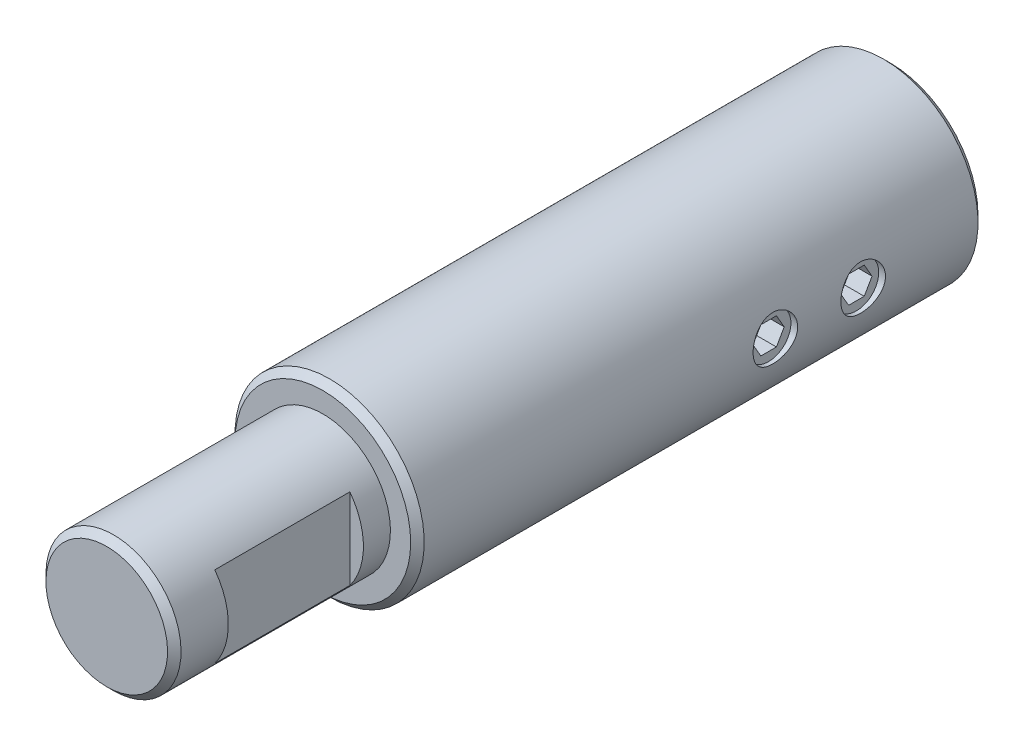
ISO-10303-21;
HEADER;
FILE_DESCRIPTION(('STEP AP214'),'2;1');
FILE_NAME('part.step','',(''),(''),'','','');
FILE_SCHEMA(('AUTOMOTIVE_DESIGN { 1 0 10303 214 1 1 1 1 }'));
ENDSEC;
DATA;
#1=APPLICATION_CONTEXT('core data for automotive mechanical design processes');
#2=APPLICATION_PROTOCOL_DEFINITION('international standard','automotive_design',2000,#1);
#3=PRODUCT_CONTEXT('',#1,'mechanical');
#4=PRODUCT('Part','Part','',(#3));
#5=PRODUCT_RELATED_PRODUCT_CATEGORY('part','',(#4));
#6=PRODUCT_DEFINITION_FORMATION('','',#4);
#7=PRODUCT_DEFINITION_CONTEXT('part definition',#1,'design');
#8=PRODUCT_DEFINITION('design','',#6,#7);
#9=PRODUCT_DEFINITION_SHAPE('','',#8);
#10=(LENGTH_UNIT() NAMED_UNIT(*) SI_UNIT(.MILLI.,.METRE.));
#11=(NAMED_UNIT(*) PLANE_ANGLE_UNIT() SI_UNIT($,.RADIAN.));
#12=(NAMED_UNIT(*) SI_UNIT($,.STERADIAN.) SOLID_ANGLE_UNIT());
#13=UNCERTAINTY_MEASURE_WITH_UNIT(LENGTH_MEASURE(1.E-05),#10,'distance_accuracy_value','');
#14=(GEOMETRIC_REPRESENTATION_CONTEXT(3) GLOBAL_UNCERTAINTY_ASSIGNED_CONTEXT((#13)) GLOBAL_UNIT_ASSIGNED_CONTEXT((#10,
#11,#12)) REPRESENTATION_CONTEXT('',''));
#15=CARTESIAN_POINT('',(0.,0.,0.));
#16=DIRECTION('',(0.,0.,1.));
#17=DIRECTION('',(1.,0.,0.));
#18=AXIS2_PLACEMENT_3D('',#15,#16,#17);
#19=CARTESIAN_POINT('',(5.,-1.,16.0773502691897));
#20=DIRECTION('',(1.,0.,0.));
#21=DIRECTION('',(0.,0.5,0.866025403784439));
#22=AXIS2_PLACEMENT_3D('',#19,#20,#21);
#23=PLANE('',#22);
#24=DIRECTION('',(0.,-0.866025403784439,-0.5));
#25=VECTOR('',#24,1.);
#26=CARTESIAN_POINT('',(5.,0.,16.6547005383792));
#27=LINE('',#26,#25);
#28=CARTESIAN_POINT('',(5.,0.,16.6547005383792));
#29=VERTEX_POINT('',#28);
#30=CARTESIAN_POINT('',(5.,-1.,16.0773502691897));
#31=VERTEX_POINT('',#30);
#32=EDGE_CURVE('E96',#29,#31,#27,.T.);
#33=ORIENTED_EDGE('',*,*,#32,.T.);
#34=DIRECTION('',(0.,0.,-1.));
#35=VECTOR('',#34,1.);
#36=CARTESIAN_POINT('',(5.,-1.,16.0773502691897));
#37=LINE('',#36,#35);
#38=CARTESIAN_POINT('',(5.,-1.,14.9226497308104));
#39=VERTEX_POINT('',#38);
#40=EDGE_CURVE('E732',#31,#39,#37,.T.);
#41=ORIENTED_EDGE('',*,*,#40,.T.);
#42=DIRECTION('',(0.,0.866025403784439,-0.5));
#43=VECTOR('',#42,1.);
#44=CARTESIAN_POINT('',(5.,-1.,14.9226497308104));
#45=LINE('',#44,#43);
#46=CARTESIAN_POINT('',(5.,0.,14.3452994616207));
#47=VERTEX_POINT('',#46);
#48=EDGE_CURVE('E728',#39,#47,#45,.T.);
#49=ORIENTED_EDGE('',*,*,#48,.T.);
#50=DIRECTION('',(0.,0.866025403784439,0.5));
#51=VECTOR('',#50,1.);
#52=CARTESIAN_POINT('',(5.,0.,14.3452994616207));
#53=LINE('',#52,#51);
#54=CARTESIAN_POINT('',(5.,1.,14.9226497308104));
#55=VERTEX_POINT('',#54);
#56=EDGE_CURVE('E731',#47,#55,#53,.T.);
#57=ORIENTED_EDGE('',*,*,#56,.T.);
#58=DIRECTION('',(0.,0.,1.));
#59=VECTOR('',#58,1.);
#60=CARTESIAN_POINT('',(5.,1.,14.9226497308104));
#61=LINE('',#60,#59);
#62=CARTESIAN_POINT('',(5.,1.,16.0773502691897));
#63=VERTEX_POINT('',#62);
#64=EDGE_CURVE('E736',#55,#63,#61,.T.);
#65=ORIENTED_EDGE('',*,*,#64,.T.);
#66=DIRECTION('',(0.,-0.866025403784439,0.5));
#67=VECTOR('',#66,1.);
#68=CARTESIAN_POINT('',(5.,1.,16.0773502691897));
#69=LINE('',#68,#67);
#70=EDGE_CURVE('E121',#63,#29,#69,.T.);
#71=ORIENTED_EDGE('',*,*,#70,.T.);
#72=EDGE_LOOP('',(#33,#41,#49,#57,#65,#71));
#73=FACE_BOUND('',#72,.T.);
#74=ADVANCED_FACE('F14',(#73),#23,.T.);
#75=CARTESIAN_POINT('',(5.,-1.,16.0773502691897));
#76=DIRECTION('',(0.,-1.,0.));
#77=DIRECTION('',(0.,0.,-1.));
#78=AXIS2_PLACEMENT_3D('',#75,#76,#77);
#79=PLANE('',#78);
#80=DIRECTION('',(0.,0.,-1.));
#81=VECTOR('',#80,1.);
#82=CARTESIAN_POINT('',(6.5,-1.,16.0773502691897));
#83=LINE('',#82,#81);
#84=CARTESIAN_POINT('',(6.5,-1.,16.0773502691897));
#85=VERTEX_POINT('',#84);
#86=CARTESIAN_POINT('',(6.5,-1.,14.9226497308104));
#87=VERTEX_POINT('',#86);
#88=EDGE_CURVE('E116',#85,#87,#83,.T.);
#89=ORIENTED_EDGE('',*,*,#88,.T.);
#90=DIRECTION('',(1.,0.,0.));
#91=VECTOR('',#90,1.);
#92=CARTESIAN_POINT('',(5.,-1.,14.9226497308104));
#93=LINE('',#92,#91);
#94=EDGE_CURVE('E135',#39,#87,#93,.T.);
#95=ORIENTED_EDGE('',*,*,#94,.F.);
#96=ORIENTED_EDGE('',*,*,#40,.F.);
#97=DIRECTION('',(1.,0.,0.));
#98=VECTOR('',#97,1.);
#99=CARTESIAN_POINT('',(5.,-1.,16.0773502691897));
#100=LINE('',#99,#98);
#101=EDGE_CURVE('E137',#31,#85,#100,.T.);
#102=ORIENTED_EDGE('',*,*,#101,.T.);
#103=EDGE_LOOP('',(#89,#95,#96,#102));
#104=FACE_BOUND('',#103,.T.);
#105=ADVANCED_FACE('F443',(#104),#79,.F.);
#106=CARTESIAN_POINT('',(5.,-1.,14.9226497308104));
#107=DIRECTION('',(0.,-0.5,-0.866025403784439));
#108=DIRECTION('',(1.,0.,0.));
#109=AXIS2_PLACEMENT_3D('',#106,#107,#108);
#110=PLANE('',#109);
#111=DIRECTION('',(0.,0.866025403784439,-0.5));
#112=VECTOR('',#111,1.);
#113=CARTESIAN_POINT('',(6.5,-1.,14.9226497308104));
#114=LINE('',#113,#112);
#115=CARTESIAN_POINT('',(6.5,0.,14.3452994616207));
#116=VERTEX_POINT('',#115);
#117=EDGE_CURVE('E118',#87,#116,#114,.T.);
#118=ORIENTED_EDGE('',*,*,#117,.T.);
#119=DIRECTION('',(1.,0.,0.));
#120=VECTOR('',#119,1.);
#121=CARTESIAN_POINT('',(5.,0.,14.3452994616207));
#122=LINE('',#121,#120);
#123=EDGE_CURVE('E133',#47,#116,#122,.T.);
#124=ORIENTED_EDGE('',*,*,#123,.F.);
#125=ORIENTED_EDGE('',*,*,#48,.F.);
#126=ORIENTED_EDGE('',*,*,#94,.T.);
#127=EDGE_LOOP('',(#118,#124,#125,#126));
#128=FACE_BOUND('',#127,.T.);
#129=ADVANCED_FACE('F454',(#128),#110,.F.);
#130=CARTESIAN_POINT('',(5.,0.,14.3452994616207));
#131=DIRECTION('',(0.,0.5,-0.866025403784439));
#132=DIRECTION('',(0.,0.866025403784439,0.5));
#133=AXIS2_PLACEMENT_3D('',#130,#131,#132);
#134=PLANE('',#133);
#135=DIRECTION('',(0.,0.866025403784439,0.5));
#136=VECTOR('',#135,1.);
#137=CARTESIAN_POINT('',(6.5,0.,14.3452994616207));
#138=LINE('',#137,#136);
#139=CARTESIAN_POINT('',(6.5,1.,14.9226497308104));
#140=VERTEX_POINT('',#139);
#141=EDGE_CURVE('E126',#116,#140,#138,.T.);
#142=ORIENTED_EDGE('',*,*,#141,.T.);
#143=DIRECTION('',(1.,0.,0.));
#144=VECTOR('',#143,1.);
#145=CARTESIAN_POINT('',(5.,1.,14.9226497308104));
#146=LINE('',#145,#144);
#147=EDGE_CURVE('E131',#55,#140,#146,.T.);
#148=ORIENTED_EDGE('',*,*,#147,.F.);
#149=ORIENTED_EDGE('',*,*,#56,.F.);
#150=ORIENTED_EDGE('',*,*,#123,.T.);
#151=EDGE_LOOP('',(#142,#148,#149,#150));
#152=FACE_BOUND('',#151,.T.);
#153=ADVANCED_FACE('F450',(#152),#134,.F.);
#154=CARTESIAN_POINT('',(5.,1.,14.9226497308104));
#155=DIRECTION('',(0.,1.,0.));
#156=DIRECTION('',(0.,0.,1.));
#157=AXIS2_PLACEMENT_3D('',#154,#155,#156);
#158=PLANE('',#157);
#159=DIRECTION('',(0.,0.,1.));
#160=VECTOR('',#159,1.);
#161=CARTESIAN_POINT('',(6.5,1.,14.9226497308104));
#162=LINE('',#161,#160);
#163=CARTESIAN_POINT('',(6.5,1.,16.0773502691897));
#164=VERTEX_POINT('',#163);
#165=EDGE_CURVE('E109',#140,#164,#162,.T.);
#166=ORIENTED_EDGE('',*,*,#165,.T.);
#167=DIRECTION('',(1.,0.,0.));
#168=VECTOR('',#167,1.);
#169=CARTESIAN_POINT('',(5.,1.,16.0773502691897));
#170=LINE('',#169,#168);
#171=EDGE_CURVE('E101',#63,#164,#170,.T.);
#172=ORIENTED_EDGE('',*,*,#171,.F.);
#173=ORIENTED_EDGE('',*,*,#64,.F.);
#174=ORIENTED_EDGE('',*,*,#147,.T.);
#175=EDGE_LOOP('',(#166,#172,#173,#174));
#176=FACE_BOUND('',#175,.T.);
#177=ADVANCED_FACE('F447',(#176),#158,.F.);
#178=CARTESIAN_POINT('',(5.,1.,16.0773502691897));
#179=DIRECTION('',(0.,0.5,0.866025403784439));
#180=DIRECTION('',(-1.,0.,0.));
#181=AXIS2_PLACEMENT_3D('',#178,#179,#180);
#182=PLANE('',#181);
#183=DIRECTION('',(0.,-0.866025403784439,0.5));
#184=VECTOR('',#183,1.);
#185=CARTESIAN_POINT('',(6.5,1.,16.0773502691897));
#186=LINE('',#185,#184);
#187=CARTESIAN_POINT('',(6.5,0.,16.6547005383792));
#188=VERTEX_POINT('',#187);
#189=EDGE_CURVE('E104',#164,#188,#186,.T.);
#190=ORIENTED_EDGE('',*,*,#189,.T.);
#191=DIRECTION('',(1.,0.,0.));
#192=VECTOR('',#191,1.);
#193=CARTESIAN_POINT('',(5.,0.,16.6547005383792));
#194=LINE('',#193,#192);
#195=EDGE_CURVE('E89',#29,#188,#194,.T.);
#196=ORIENTED_EDGE('',*,*,#195,.F.);
#197=ORIENTED_EDGE('',*,*,#70,.F.);
#198=ORIENTED_EDGE('',*,*,#171,.T.);
#199=EDGE_LOOP('',(#190,#196,#197,#198));
#200=FACE_BOUND('',#199,.T.);
#201=ADVANCED_FACE('F105',(#200),#182,.F.);
#202=CARTESIAN_POINT('',(5.,0.,16.6547005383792));
#203=DIRECTION('',(0.,-0.5,0.866025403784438));
#204=DIRECTION('',(0.,-0.866025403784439,-0.5));
#205=AXIS2_PLACEMENT_3D('',#202,#203,#204);
#206=PLANE('',#205);
#207=DIRECTION('',(0.,-0.866025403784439,-0.5));
#208=VECTOR('',#207,1.);
#209=CARTESIAN_POINT('',(6.5,0.,16.6547005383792));
#210=LINE('',#209,#208);
#211=EDGE_CURVE('E93',#188,#85,#210,.T.);
#212=ORIENTED_EDGE('',*,*,#211,.T.);
#213=ORIENTED_EDGE('',*,*,#101,.F.);
#214=ORIENTED_EDGE('',*,*,#32,.F.);
#215=ORIENTED_EDGE('',*,*,#195,.T.);
#216=EDGE_LOOP('',(#212,#213,#214,#215));
#217=FACE_BOUND('',#216,.T.);
#218=ADVANCED_FACE('F91',(#217),#206,.F.);
#219=CARTESIAN_POINT('',(6.5,-1.73205080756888,16.5));
#220=DIRECTION('',(1.,0.,0.));
#221=DIRECTION('',(0.,0.866025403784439,-0.5));
#222=AXIS2_PLACEMENT_3D('',#219,#220,#221);
#223=PLANE('',#222);
#224=ORIENTED_EDGE('',*,*,#211,.F.);
#225=ORIENTED_EDGE('',*,*,#189,.F.);
#226=ORIENTED_EDGE('',*,*,#165,.F.);
#227=ORIENTED_EDGE('',*,*,#141,.F.);
#228=ORIENTED_EDGE('',*,*,#117,.F.);
#229=ORIENTED_EDGE('',*,*,#88,.F.);
#230=EDGE_LOOP('',(#224,#225,#226,#227,#228,#229));
#231=FACE_BOUND('',#230,.T.);
#232=CARTESIAN_POINT('',(6.5,0.,15.5));
#233=DIRECTION('',(1.,0.,0.));
#234=DIRECTION('',(0.,0.,1.));
#235=AXIS2_PLACEMENT_3D('',#232,#233,#234);
#236=CIRCLE('',#235,1.65);
#237=CARTESIAN_POINT('',(6.5,0.,17.15));
#238=VERTEX_POINT('',#237);
#239=EDGE_CURVE('E374',#238,#238,#236,.F.);
#240=ORIENTED_EDGE('',*,*,#239,.F.);
#241=EDGE_LOOP('',(#240));
#242=FACE_BOUND('',#241,.T.);
#243=ADVANCED_FACE('F112',(#231,#242),#223,.T.);
#244=CARTESIAN_POINT('',(2.5,0.,15.5));
#245=DIRECTION('',(-1.,0.,0.));
#246=DIRECTION('',(0.,-0.866025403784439,0.5));
#247=AXIS2_PLACEMENT_3D('',#244,#245,#246);
#248=CYLINDRICAL_SURFACE('',#247,2.);
#249=CARTESIAN_POINT('',(3.25,0.,15.5));
#250=DIRECTION('',(-1.,0.,0.));
#251=DIRECTION('',(0.,-0.866025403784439,0.5));
#252=AXIS2_PLACEMENT_3D('',#249,#250,#251);
#253=CIRCLE('',#252,2.);
#254=CARTESIAN_POINT('',(3.25,-1.73205080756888,16.5));
#255=VERTEX_POINT('',#254);
#256=EDGE_CURVE('E100',#255,#255,#253,.T.);
#257=ORIENTED_EDGE('',*,*,#256,.F.);
#258=EDGE_LOOP('',(#257));
#259=FACE_BOUND('',#258,.T.);
#260=CARTESIAN_POINT('',(3.60555127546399,-1.73205080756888,16.5));
#261=CARTESIAN_POINT('',(3.58114105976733,-1.78286595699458,16.4119810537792));
#262=CARTESIAN_POINT('',(3.55851558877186,-1.82721585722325,16.3196574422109));
#263=CARTESIAN_POINT('',(3.51934118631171,-1.90158334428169,16.1281189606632));
#264=CARTESIAN_POINT('',(3.50279417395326,-1.93159640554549,16.0289019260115));
#265=CARTESIAN_POINT('',(3.47789693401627,-1.97608216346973,15.8255267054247));
#266=CARTESIAN_POINT('',(3.46958244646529,-1.99048712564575,15.7213490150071));
#267=CARTESIAN_POINT('',(3.46254046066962,-2.00271609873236,15.5117347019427));
#268=CARTESIAN_POINT('',(3.46380774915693,-2.00054912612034,15.4062987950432));
#269=CARTESIAN_POINT('',(3.47533006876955,-1.9804519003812,15.2042490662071));
#270=CARTESIAN_POINT('',(3.48501210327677,-1.96352638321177,15.107498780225));
#271=CARTESIAN_POINT('',(3.51133562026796,-1.91605072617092,14.9183957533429));
#272=CARTESIAN_POINT('',(3.5279800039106,-1.8854949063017,14.8260448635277));
#273=CARTESIAN_POINT('',(3.56720138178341,-1.8102328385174,14.6437215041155));
#274=CARTESIAN_POINT('',(3.59000739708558,-1.76496258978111,14.5540329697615));
#275=CARTESIAN_POINT('',(3.63880492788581,-1.66202914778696,14.3830255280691));
#276=CARTESIAN_POINT('',(3.66479803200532,-1.60435976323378,14.3017108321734));
#277=CARTESIAN_POINT('',(3.72099396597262,-1.46974977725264,14.1389909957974));
#278=CARTESIAN_POINT('',(3.75131362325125,-1.39129469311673,14.0588735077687));
#279=CARTESIAN_POINT('',(3.80993804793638,-1.22164869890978,13.9125085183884));
#280=CARTESIAN_POINT('',(3.83824207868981,-1.13045316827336,13.8462660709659));
#281=CARTESIAN_POINT('',(3.89074540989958,-0.934192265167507,13.7277668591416));
#282=CARTESIAN_POINT('',(3.91479325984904,-0.828788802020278,13.6759980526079));
#283=CARTESIAN_POINT('',(3.95490274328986,-0.60922541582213,13.5914270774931));
#284=CARTESIAN_POINT('',(3.97097125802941,-0.495073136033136,13.5586085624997));
#285=CARTESIAN_POINT('',(3.99214121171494,-0.272357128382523,13.5156858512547));
#286=CARTESIAN_POINT('',(3.99810116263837,-0.164218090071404,13.5037998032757));
#287=CARTESIAN_POINT('',(4.00112100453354,0.0526621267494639,13.4977560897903));
#288=CARTESIAN_POINT('',(3.99818425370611,0.161403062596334,13.5035917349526));
#289=CARTESIAN_POINT('',(3.98424622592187,0.368553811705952,13.5316638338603));
#290=CARTESIAN_POINT('',(3.97381010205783,0.467161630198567,13.5527515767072));
#291=CARTESIAN_POINT('',(3.9464899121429,0.65926976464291,13.6091300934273));
#292=CARTESIAN_POINT('',(3.92960496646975,0.752769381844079,13.6444228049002));
#293=CARTESIAN_POINT('',(3.89006951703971,0.936225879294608,13.7296550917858));
#294=CARTESIAN_POINT('',(3.86721550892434,1.02589170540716,13.780123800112));
#295=CARTESIAN_POINT('',(3.81808874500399,1.19584152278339,13.8936318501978));
#296=CARTESIAN_POINT('',(3.7918143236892,1.2761209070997,13.9566773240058));
#297=CARTESIAN_POINT('',(3.73535533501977,1.43345089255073,14.1008198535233));
#298=CARTESIAN_POINT('',(3.70504192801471,1.50938403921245,14.1830892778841));
#299=CARTESIAN_POINT('',(3.64605626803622,1.64677744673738,14.3595453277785));
#300=CARTESIAN_POINT('',(3.61738497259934,1.70822932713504,14.4537388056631));
#301=CARTESIAN_POINT('',(3.56413876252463,1.81678439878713,14.6556812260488));
#302=CARTESIAN_POINT('',(3.53973935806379,1.86331923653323,14.7637857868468));
#303=CARTESIAN_POINT('',(3.50001541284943,1.93692452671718,14.9879564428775));
#304=CARTESIAN_POINT('',(3.4846779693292,1.96402266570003,15.1040109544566));
#305=CARTESIAN_POINT('',(3.46680998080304,1.99537374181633,15.3273572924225));
#306=CARTESIAN_POINT('',(3.46308171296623,2.00176620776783,15.4342529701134));
#307=CARTESIAN_POINT('',(3.46560457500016,1.99739699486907,15.6475619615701));
#308=CARTESIAN_POINT('',(3.47185336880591,1.98663933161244,15.7539753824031));
#309=CARTESIAN_POINT('',(3.49245469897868,1.95016398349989,15.9542974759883));
#310=CARTESIAN_POINT('',(3.50610804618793,1.92573191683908,16.0485199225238));
#311=CARTESIAN_POINT('',(3.53934766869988,1.86393215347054,16.2314981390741));
#312=CARTESIAN_POINT('',(3.55893579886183,1.82656041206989,16.3202521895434));
#313=CARTESIAN_POINT('',(3.60382136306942,1.73643330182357,16.4977517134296));
#314=CARTESIAN_POINT('',(3.62945590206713,1.6826653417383,16.5858958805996));
#315=CARTESIAN_POINT('',(3.68274387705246,1.56259803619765,16.7525364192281));
#316=CARTESIAN_POINT('',(3.71039854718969,1.49629099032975,16.8310268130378));
#317=CARTESIAN_POINT('',(3.76842385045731,1.34400695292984,16.9855041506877));
#318=CARTESIAN_POINT('',(3.79873884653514,1.25664214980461,17.0601525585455));
#319=CARTESIAN_POINT('',(3.8555873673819,1.06957585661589,17.1938772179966));
#320=CARTESIAN_POINT('',(3.88212084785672,0.969874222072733,17.2529532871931));
#321=CARTESIAN_POINT('',(3.9282867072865,0.761464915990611,17.3529399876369));
#322=CARTESIAN_POINT('',(3.94798451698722,0.652855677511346,17.3940238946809));
#323=CARTESIAN_POINT('',(3.97852379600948,0.429025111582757,17.45688950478));
#324=CARTESIAN_POINT('',(3.98937317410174,0.313809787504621,17.4786884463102));
#325=CARTESIAN_POINT('',(4.00030998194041,0.0925080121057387,17.5006381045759));
#326=CARTESIAN_POINT('',(4.0013638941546,-0.0133411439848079,17.5027332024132));
#327=CARTESIAN_POINT('',(3.9951211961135,-0.223779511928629,17.4902323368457));
#328=CARTESIAN_POINT('',(3.98782647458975,-0.328369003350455,17.4756401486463));
#329=CARTESIAN_POINT('',(3.96611073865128,-0.528893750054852,17.4314199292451));
#330=CARTESIAN_POINT('',(3.95199804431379,-0.625008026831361,17.4024410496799));
#331=CARTESIAN_POINT('',(3.91806680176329,-0.810986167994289,17.3309114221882));
#332=CARTESIAN_POINT('',(3.8982454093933,-0.900846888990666,17.2883539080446));
#333=CARTESIAN_POINT('',(3.85310803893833,-1.07818171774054,17.1877773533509));
#334=CARTESIAN_POINT('',(3.82751681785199,-1.16511208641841,17.1289268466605));
#335=CARTESIAN_POINT('',(3.77400379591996,-1.32825598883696,16.9988704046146));
#336=CARTESIAN_POINT('',(3.74608351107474,-1.40447640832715,16.9276724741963));
#337=CARTESIAN_POINT('',(3.69880314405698,-1.52369323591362,16.7975445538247));
#338=CARTESIAN_POINT('',(3.67940675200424,-1.5697679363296,16.7414121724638));
#339=CARTESIAN_POINT('',(3.64155013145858,-1.6556917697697,16.6242610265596));
#340=CARTESIAN_POINT('',(3.6230900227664,-1.69554010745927,16.56324163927));
#341=CARTESIAN_POINT('',(3.60555127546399,-1.73205080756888,16.5));
#342=B_SPLINE_CURVE_WITH_KNOTS('',3,(#260,#261,#262,#263,#264,#265,#266,#267,#268,#269,#270,
#271,#272,#273,#274,#275,#276,#277,#278,#279,#280,#281,#282,#283,#284,#285,#286,#287,#288,#289,
#290,#291,#292,#293,#294,#295,#296,#297,#298,#299,#300,#301,#302,#303,#304,#305,#306,#307,#308,
#309,#310,#311,#312,#313,#314,#315,#316,#317,#318,#319,#320,#321,#322,#323,#324,#325,#326,#327,
#328,#329,#330,#331,#332,#333,#334,#335,#336,#337,#338,#339,#340,#341),.UNSPECIFIED.,.T.,.F.,(4,
2,2,2,2,2,2,2,2,2,2,2,2,2,2,2,2,2,2,2,2,2,2,2,2,2,2,2,2,2,2,2,2,2,2,2,2,2,2,2,4),(0.,
0.313340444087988,0.626779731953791,0.94157387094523,1.25619674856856,1.55093857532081,
1.84580334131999,2.15365600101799,2.46166274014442,2.80860037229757,3.15566415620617,
3.51330900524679,3.87064488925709,4.19574837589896,4.5207291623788,4.82348895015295,
5.12629004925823,5.44119619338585,5.75625625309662,6.1026878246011,6.44931939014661,
6.80791311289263,7.16599501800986,7.48564995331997,7.80523005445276,8.09886150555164,
8.39258482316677,8.71047038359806,9.02855179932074,9.38340715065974,9.73826665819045,
10.0896291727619,10.4406772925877,10.7566703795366,11.0725919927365,11.3754022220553,
11.6783635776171,12.0012093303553,12.3238465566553,12.5489530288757,12.7740882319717),.UNSPECIFIED.);
#343=CARTESIAN_POINT('',(3.60555127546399,-1.73205080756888,16.5));
#344=VERTEX_POINT('',#343);
#345=EDGE_CURVE('E203',#344,#344,#342,.T.);
#346=ORIENTED_EDGE('',*,*,#345,.F.);
#347=EDGE_LOOP('',(#346));
#348=FACE_BOUND('',#347,.T.);
#349=ADVANCED_FACE('F465',(#259,#348),#248,.T.);
#350=CARTESIAN_POINT('',(2.5,0.,15.5));
#351=DIRECTION('',(-1.,0.,0.));
#352=DIRECTION('',(0.,-0.866025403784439,0.5));
#353=AXIS2_PLACEMENT_3D('',#350,#351,#352);
#354=PLANE('',#353);
#355=CARTESIAN_POINT('',(2.5,0.,15.5));
#356=DIRECTION('',(-1.,0.,0.));
#357=DIRECTION('',(0.,-0.866025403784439,0.5));
#358=AXIS2_PLACEMENT_3D('',#355,#356,#357);
#359=CIRCLE('',#358,1.25);
#360=CARTESIAN_POINT('',(2.5,-1.08253175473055,16.125));
#361=VERTEX_POINT('',#360);
#362=EDGE_CURVE('E18',#361,#361,#359,.T.);
#363=ORIENTED_EDGE('',*,*,#362,.T.);
#364=EDGE_LOOP('',(#363));
#365=FACE_BOUND('',#364,.T.);
#366=ADVANCED_FACE('F16',(#365),#354,.T.);
#367=CARTESIAN_POINT('',(2.5,0.,15.5));
#368=DIRECTION('',(1.,0.,0.));
#369=DIRECTION('',(0.,0.866025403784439,-0.5));
#370=AXIS2_PLACEMENT_3D('',#367,#368,#369);
#371=CONICAL_SURFACE('',#370,1.25,0.78539816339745);
#372=ORIENTED_EDGE('',*,*,#256,.T.);
#373=EDGE_LOOP('',(#372));
#374=FACE_BOUND('',#373,.T.);
#375=ORIENTED_EDGE('',*,*,#362,.F.);
#376=EDGE_LOOP('',(#375));
#377=FACE_BOUND('',#376,.T.);
#378=ADVANCED_FACE('F224',(#374,#377),#371,.T.);
#379=CARTESIAN_POINT('',(-5.,0.,58.));
#380=DIRECTION('',(0.,0.,-1.));
#381=DIRECTION('',(0.,-1.,0.));
#382=AXIS2_PLACEMENT_3D('',#379,#380,#381);
#383=PLANE('',#382);
#384=CARTESIAN_POINT('',(0.,0.,58.));
#385=DIRECTION('',(0.,0.,-1.));
#386=DIRECTION('',(0.,-1.,0.));
#387=AXIS2_PLACEMENT_3D('',#384,#385,#386);
#388=CIRCLE('',#387,4.5);
#389=CARTESIAN_POINT('',(0.,-4.5,58.));
#390=VERTEX_POINT('',#389);
#391=EDGE_CURVE('E378',#390,#390,#388,.F.);
#392=ORIENTED_EDGE('',*,*,#391,.T.);
#393=EDGE_LOOP('',(#392));
#394=FACE_BOUND('',#393,.T.);
#395=ADVANCED_FACE('F240',(#394),#383,.F.);
#396=CARTESIAN_POINT('',(0.,0.,54.));
#397=DIRECTION('',(0.,0.,1.));
#398=DIRECTION('',(0.,1.,0.));
#399=AXIS2_PLACEMENT_3D('',#396,#397,#398);
#400=PLANE('',#399);
#401=CARTESIAN_POINT('',(0.,0.,54.));
#402=DIRECTION('',(0.,0.,1.));
#403=DIRECTION('',(0.,1.,0.));
#404=AXIS2_PLACEMENT_3D('',#401,#402,#403);
#405=CIRCLE('',#404,5.);
#406=CARTESIAN_POINT('',(4.,-3.,54.));
#407=VERTEX_POINT('',#406);
#408=CARTESIAN_POINT('',(4.,3.,54.));
#409=VERTEX_POINT('',#408);
#410=EDGE_CURVE('E142',#407,#409,#405,.T.);
#411=ORIENTED_EDGE('',*,*,#410,.F.);
#412=DIRECTION('',(0.,-1.,0.));
#413=VECTOR('',#412,1.);
#414=CARTESIAN_POINT('',(4.,-3.,54.));
#415=LINE('',#414,#413);
#416=EDGE_CURVE('E146',#409,#407,#415,.T.);
#417=ORIENTED_EDGE('',*,*,#416,.F.);
#418=EDGE_LOOP('',(#411,#417));
#419=FACE_BOUND('',#418,.T.);
#420=ADVANCED_FACE('F238',(#419),#400,.F.);
#421=CARTESIAN_POINT('',(4.,-3.,44.));
#422=DIRECTION('',(-1.,0.,0.));
#423=DIRECTION('',(0.,-1.,0.));
#424=AXIS2_PLACEMENT_3D('',#421,#422,#423);
#425=PLANE('',#424);
#426=ORIENTED_EDGE('',*,*,#416,.T.);
#427=DIRECTION('',(0.,0.,1.));
#428=VECTOR('',#427,1.);
#429=CARTESIAN_POINT('',(4.,-3.,44.));
#430=LINE('',#429,#428);
#431=CARTESIAN_POINT('',(4.,-3.,44.));
#432=VERTEX_POINT('',#431);
#433=EDGE_CURVE('E158',#432,#407,#430,.T.);
#434=ORIENTED_EDGE('',*,*,#433,.F.);
#435=DIRECTION('',(0.,-1.,0.));
#436=VECTOR('',#435,1.);
#437=CARTESIAN_POINT('',(4.,-3.,44.));
#438=LINE('',#437,#436);
#439=CARTESIAN_POINT('',(4.,3.,44.));
#440=VERTEX_POINT('',#439);
#441=EDGE_CURVE('E155',#440,#432,#438,.T.);
#442=ORIENTED_EDGE('',*,*,#441,.F.);
#443=DIRECTION('',(0.,0.,1.));
#444=VECTOR('',#443,1.);
#445=CARTESIAN_POINT('',(4.,3.,44.));
#446=LINE('',#445,#444);
#447=EDGE_CURVE('E161',#440,#409,#446,.T.);
#448=ORIENTED_EDGE('',*,*,#447,.T.);
#449=EDGE_LOOP('',(#426,#434,#442,#448));
#450=FACE_BOUND('',#449,.T.);
#451=ADVANCED_FACE('F188',(#450),#425,.F.);
#452=CARTESIAN_POINT('',(0.,0.,44.));
#453=DIRECTION('',(0.,0.,1.));
#454=DIRECTION('',(0.,1.,0.));
#455=AXIS2_PLACEMENT_3D('',#452,#453,#454);
#456=PLANE('',#455);
#457=CARTESIAN_POINT('',(0.,0.,44.));
#458=DIRECTION('',(0.,0.,1.));
#459=DIRECTION('',(0.,1.,0.));
#460=AXIS2_PLACEMENT_3D('',#457,#458,#459);
#461=CIRCLE('',#460,5.);
#462=EDGE_CURVE('E152',#432,#440,#461,.T.);
#463=ORIENTED_EDGE('',*,*,#462,.T.);
#464=ORIENTED_EDGE('',*,*,#441,.T.);
#465=EDGE_LOOP('',(#463,#464));
#466=FACE_BOUND('',#465,.T.);
#467=ADVANCED_FACE('F234',(#466),#456,.T.);
#468=CARTESIAN_POINT('',(0.,0.,57.5));
#469=DIRECTION('',(0.,0.,-1.));
#470=DIRECTION('',(0.,-1.,0.));
#471=AXIS2_PLACEMENT_3D('',#468,#469,#470);
#472=CONICAL_SURFACE('',#471,5.,0.78539816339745);
#473=ORIENTED_EDGE('',*,*,#391,.F.);
#474=EDGE_LOOP('',(#473));
#475=FACE_BOUND('',#474,.T.);
#476=CARTESIAN_POINT('',(0.,0.,57.5));
#477=DIRECTION('',(0.,0.,-1.));
#478=DIRECTION('',(0.,-1.,0.));
#479=AXIS2_PLACEMENT_3D('',#476,#477,#478);
#480=CIRCLE('',#479,5.);
#481=CARTESIAN_POINT('',(0.,-5.,57.5));
#482=VERTEX_POINT('',#481);
#483=EDGE_CURVE('E381',#482,#482,#480,.T.);
#484=ORIENTED_EDGE('',*,*,#483,.F.);
#485=EDGE_LOOP('',(#484));
#486=FACE_BOUND('',#485,.T.);
#487=ADVANCED_FACE('F236',(#475,#486),#472,.T.);
#488=CARTESIAN_POINT('',(0.,0.,0.));
#489=DIRECTION('',(0.,0.,-1.));
#490=DIRECTION('',(0.,-1.,0.));
#491=AXIS2_PLACEMENT_3D('',#488,#489,#490);
#492=CYLINDRICAL_SURFACE('',#491,5.);
#493=ORIENTED_EDGE('',*,*,#483,.T.);
#494=EDGE_LOOP('',(#493));
#495=FACE_BOUND('',#494,.T.);
#496=CARTESIAN_POINT('',(0.,0.,42.));
#497=DIRECTION('',(0.,0.,-1.));
#498=DIRECTION('',(0.,-1.,0.));
#499=AXIS2_PLACEMENT_3D('',#496,#497,#498);
#500=CIRCLE('',#499,5.);
#501=CARTESIAN_POINT('',(0.,-5.,42.));
#502=VERTEX_POINT('',#501);
#503=EDGE_CURVE('E404',#502,#502,#500,.T.);
#504=ORIENTED_EDGE('',*,*,#503,.F.);
#505=EDGE_LOOP('',(#504));
#506=FACE_BOUND('',#505,.T.);
#507=ORIENTED_EDGE('',*,*,#462,.F.);
#508=ORIENTED_EDGE('',*,*,#433,.T.);
#509=ORIENTED_EDGE('',*,*,#410,.T.);
#510=ORIENTED_EDGE('',*,*,#447,.F.);
#511=EDGE_LOOP('',(#507,#508,#509,#510));
#512=FACE_BOUND('',#511,.T.);
#513=ADVANCED_FACE('F439',(#495,#506,#512),#492,.T.);
#514=CARTESIAN_POINT('',(-7.,0.,42.));
#515=DIRECTION('',(0.,0.,-1.));
#516=DIRECTION('',(0.,-1.,0.));
#517=AXIS2_PLACEMENT_3D('',#514,#515,#516);
#518=PLANE('',#517);
#519=CARTESIAN_POINT('',(0.,0.,42.));
#520=DIRECTION('',(0.,0.,-1.));
#521=DIRECTION('',(0.,-1.,0.));
#522=AXIS2_PLACEMENT_3D('',#519,#520,#521);
#523=CIRCLE('',#522,6.5);
#524=CARTESIAN_POINT('',(0.,-6.5,42.));
#525=VERTEX_POINT('',#524);
#526=EDGE_CURVE('E386',#525,#525,#523,.F.);
#527=ORIENTED_EDGE('',*,*,#526,.T.);
#528=EDGE_LOOP('',(#527));
#529=FACE_BOUND('',#528,.T.);
#530=ORIENTED_EDGE('',*,*,#503,.T.);
#531=EDGE_LOOP('',(#530));
#532=FACE_BOUND('',#531,.T.);
#533=ADVANCED_FACE('F555',(#529,#532),#518,.F.);
#534=CARTESIAN_POINT('',(-4.,0.,0.));
#535=DIRECTION('',(0.,0.,1.));
#536=DIRECTION('',(0.,1.,0.));
#537=AXIS2_PLACEMENT_3D('',#534,#535,#536);
#538=PLANE('',#537);
#539=CARTESIAN_POINT('',(0.,0.,0.));
#540=DIRECTION('',(0.,0.,1.));
#541=DIRECTION('',(0.,1.,0.));
#542=AXIS2_PLACEMENT_3D('',#539,#540,#541);
#543=CIRCLE('',#542,6.5);
#544=CARTESIAN_POINT('',(0.,6.5,0.));
#545=VERTEX_POINT('',#544);
#546=EDGE_CURVE('E395',#545,#545,#543,.F.);
#547=ORIENTED_EDGE('',*,*,#546,.T.);
#548=EDGE_LOOP('',(#547));
#549=FACE_BOUND('',#548,.T.);
#550=CARTESIAN_POINT('',(0.,0.,0.));
#551=DIRECTION('',(0.,0.,1.));
#552=DIRECTION('',(0.,1.,0.));
#553=AXIS2_PLACEMENT_3D('',#550,#551,#552);
#554=CIRCLE('',#553,4.57735026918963);
#555=CARTESIAN_POINT('',(0.,4.57735026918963,0.));
#556=VERTEX_POINT('',#555);
#557=EDGE_CURVE('E398',#556,#556,#554,.T.);
#558=ORIENTED_EDGE('',*,*,#557,.T.);
#559=EDGE_LOOP('',(#558));
#560=FACE_BOUND('',#559,.T.);
#561=ADVANCED_FACE('F186',(#549,#560),#538,.F.);
#562=CARTESIAN_POINT('',(7.,0.,9.));
#563=DIRECTION('',(1.,0.,0.));
#564=DIRECTION('',(0.,1.,0.));
#565=AXIS2_PLACEMENT_3D('',#562,#563,#564);
#566=CYLINDRICAL_SURFACE('',#565,1.65);
#567=CARTESIAN_POINT('',(6.5,0.,9.));
#568=DIRECTION('',(1.,0.,0.));
#569=DIRECTION('',(0.,0.,1.));
#570=AXIS2_PLACEMENT_3D('',#567,#568,#569);
#571=CIRCLE('',#570,1.65);
#572=CARTESIAN_POINT('',(6.5,0.,10.65));
#573=VERTEX_POINT('',#572);
#574=EDGE_CURVE('E24',#573,#573,#571,.T.);
#575=ORIENTED_EDGE('',*,*,#574,.F.);
#576=EDGE_LOOP('',(#575));
#577=FACE_BOUND('',#576,.T.);
#578=CARTESIAN_POINT('',(6.80275679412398,1.65,9.));
#579=CARTESIAN_POINT('',(6.80275861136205,1.64999713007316,8.90871099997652));
#580=CARTESIAN_POINT('',(6.80461440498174,1.64239813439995,8.8173890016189));
#581=CARTESIAN_POINT('',(6.81182064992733,1.61224414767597,8.63735543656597));
#582=CARTESIAN_POINT('',(6.81717336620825,1.58967946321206,8.54864560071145));
#583=CARTESIAN_POINT('',(6.83073431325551,1.53035515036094,8.37646648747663));
#584=CARTESIAN_POINT('',(6.83893911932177,1.49361254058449,8.2929910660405));
#585=CARTESIAN_POINT('',(6.85727558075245,1.40702581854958,8.13338346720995));
#586=CARTESIAN_POINT('',(6.86740726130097,1.3571815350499,8.05725138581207));
#587=CARTESIAN_POINT('',(6.88867782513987,1.24476461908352,7.91300017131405));
#588=CARTESIAN_POINT('',(6.89983131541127,1.18198309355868,7.84504595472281));
#589=CARTESIAN_POINT('',(6.92176152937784,1.04592427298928,7.72052828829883));
#590=CARTESIAN_POINT('',(6.93253822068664,0.972646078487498,7.66396581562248));
#591=CARTESIAN_POINT('',(6.95266103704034,0.816555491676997,7.56317303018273));
#592=CARTESIAN_POINT('',(6.96198791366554,0.733636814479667,7.51910313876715));
#593=CARTESIAN_POINT('',(6.97799434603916,0.561312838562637,7.44558709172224));
#594=CARTESIAN_POINT('',(6.98467424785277,0.471908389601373,7.41613902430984));
#595=CARTESIAN_POINT('',(6.99453084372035,0.290868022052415,7.37322629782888));
#596=CARTESIAN_POINT('',(6.99776875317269,0.199301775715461,7.35948200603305));
#597=CARTESIAN_POINT('',(7.00058928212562,0.0151097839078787,7.34749086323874));
#598=CARTESIAN_POINT('',(7.00017238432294,-0.0775158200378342,7.34924196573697));
#599=CARTESIAN_POINT('',(6.99577641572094,-0.259263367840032,7.36798740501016));
#600=CARTESIAN_POINT('',(6.99186783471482,-0.348418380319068,7.38468011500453));
#601=CARTESIAN_POINT('',(6.98100889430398,-0.52262462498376,7.43235207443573));
#602=CARTESIAN_POINT('',(6.97405838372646,-0.607675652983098,7.46333203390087));
#603=CARTESIAN_POINT('',(6.95778608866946,-0.77207438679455,7.53895377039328));
#604=CARTESIAN_POINT('',(6.94844521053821,-0.851369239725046,7.58370617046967));
#605=CARTESIAN_POINT('',(6.92841069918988,-1.00143136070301,7.68551922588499));
#606=CARTESIAN_POINT('',(6.91771685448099,-1.07219729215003,7.74258180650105));
#607=CARTESIAN_POINT('',(6.89584251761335,-1.20498965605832,7.86902452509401));
#608=CARTESIAN_POINT('',(6.884656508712,-1.26676421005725,7.93866849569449));
#609=CARTESIAN_POINT('',(6.8632971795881,-1.37780936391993,8.0874443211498));
#610=CARTESIAN_POINT('',(6.85312389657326,-1.42707950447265,8.16657652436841));
#611=CARTESIAN_POINT('',(6.83492437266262,-1.51185477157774,8.33253525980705));
#612=CARTESIAN_POINT('',(6.82690665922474,-1.54730546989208,8.41939059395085));
#613=CARTESIAN_POINT('',(6.8140390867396,-1.6030277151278,8.59806127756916));
#614=CARTESIAN_POINT('',(6.80918863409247,-1.62330210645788,8.68987569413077));
#615=CARTESIAN_POINT('',(6.80332774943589,-1.64769127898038,8.87353855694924));
#616=CARTESIAN_POINT('',(6.80222947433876,-1.65217579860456,8.96533515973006));
#617=CARTESIAN_POINT('',(6.80375919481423,-1.64586488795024,9.14836457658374));
#618=CARTESIAN_POINT('',(6.80638688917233,-1.63507069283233,9.23959743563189));
#619=CARTESIAN_POINT('',(6.81498886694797,-1.59883140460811,9.41757745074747));
#620=CARTESIAN_POINT('',(6.82091521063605,-1.57359604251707,9.50436984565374));
#621=CARTESIAN_POINT('',(6.83540229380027,-1.50942069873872,9.67249368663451));
#622=CARTESIAN_POINT('',(6.84396331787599,-1.47047923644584,9.75382454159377));
#623=CARTESIAN_POINT('',(6.86294389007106,-1.37920410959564,9.91029905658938));
#624=CARTESIAN_POINT('',(6.87339357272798,-1.32664621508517,9.98530818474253));
#625=CARTESIAN_POINT('',(6.89489755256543,-1.20991829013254,10.1255780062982));
#626=CARTESIAN_POINT('',(6.90595193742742,-1.14574657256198,10.1908372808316));
#627=CARTESIAN_POINT('',(6.92771364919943,-1.00592681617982,10.3112229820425));
#628=CARTESIAN_POINT('',(6.93840801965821,-0.930057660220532,10.3660953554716));
#629=CARTESIAN_POINT('',(6.95799159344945,-0.769965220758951,10.4623180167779));
#630=CARTESIAN_POINT('',(6.96688088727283,-0.685742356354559,10.503668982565));
#631=CARTESIAN_POINT('',(6.9817988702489,-0.511894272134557,10.5713378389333));
#632=CARTESIAN_POINT('',(6.98784709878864,-0.422310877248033,10.5977586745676));
#633=CARTESIAN_POINT('',(6.99648655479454,-0.239816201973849,10.6351328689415));
#634=CARTESIAN_POINT('',(6.99907837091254,-0.146905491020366,10.6460888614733));
#635=CARTESIAN_POINT('',(7.00049202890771,0.0372082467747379,10.6520881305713));
#636=CARTESIAN_POINT('',(6.9994031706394,0.128398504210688,10.647508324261));
#637=CARTESIAN_POINT('',(6.99377268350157,0.308670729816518,10.6234197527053));
#638=CARTESIAN_POINT('',(6.98923113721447,0.397752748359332,10.6039113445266));
#639=CARTESIAN_POINT('',(6.97721604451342,0.570933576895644,10.5507117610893));
#640=CARTESIAN_POINT('',(6.96975517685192,0.655052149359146,10.5170818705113));
#641=CARTESIAN_POINT('',(6.95269208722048,0.81649879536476,10.4366509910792));
#642=CARTESIAN_POINT('',(6.94308962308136,0.893826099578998,10.3898485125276));
#643=CARTESIAN_POINT('',(6.92252474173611,1.04130725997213,10.2832139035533));
#644=CARTESIAN_POINT('',(6.91153737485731,1.11126948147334,10.2231215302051));
#645=CARTESIAN_POINT('',(6.88956325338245,1.24024523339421,10.0921276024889));
#646=CARTESIAN_POINT('',(6.8785764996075,1.29925605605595,10.0212233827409));
#647=CARTESIAN_POINT('',(6.85764827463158,1.40557849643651,9.86924540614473));
#648=CARTESIAN_POINT('',(6.84772646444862,1.45268661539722,9.7880263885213));
#649=CARTESIAN_POINT('',(6.83030721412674,1.53250931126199,9.61860266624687));
#650=CARTESIAN_POINT('',(6.82280787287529,1.56523518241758,9.53040350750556));
#651=CARTESIAN_POINT('',(6.81235745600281,1.61002842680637,9.36853084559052));
#652=CARTESIAN_POINT('',(6.80878274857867,1.62498700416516,9.29568399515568));
#653=CARTESIAN_POINT('',(6.8039817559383,1.64497362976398,9.14856531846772));
#654=CARTESIAN_POINT('',(6.80275531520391,1.65000233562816,9.07429358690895));
#655=CARTESIAN_POINT('',(6.80275679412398,1.65,9.));
#656=B_SPLINE_CURVE_WITH_KNOTS('',3,(#578,#579,#580,#581,#582,#583,#584,#585,#586,#587,#588,
#589,#590,#591,#592,#593,#594,#595,#596,#597,#598,#599,#600,#601,#602,#603,#604,#605,#606,#607,
#608,#609,#610,#611,#612,#613,#614,#615,#616,#617,#618,#619,#620,#621,#622,#623,#624,#625,#626,
#627,#628,#629,#630,#631,#632,#633,#634,#635,#636,#637,#638,#639,#640,#641,#642,#643,#644,#645,
#646,#647,#648,#649,#650,#651,#652,#653,#654,#655),.UNSPECIFIED.,.T.,.F.,(4,2,2,2,2,2,2,2,2,2,2,
2,2,2,2,2,2,2,2,2,2,2,2,2,2,2,2,2,2,2,2,2,2,2,2,2,2,2,4),(0.,0.273594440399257,
0.547366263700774,0.820810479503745,1.0942582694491,1.37252656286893,1.65081871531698,
1.9325374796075,2.21421939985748,2.49080324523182,2.76735056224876,3.03843805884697,
3.30953902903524,3.58287702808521,3.85625780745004,4.13623055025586,4.41621357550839,
4.69728844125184,4.97831061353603,5.25270687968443,5.52708096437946,5.79756789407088,
6.06808405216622,6.34337456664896,6.61870510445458,6.90008328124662,7.18144734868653,
7.46084693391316,7.74019892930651,8.01282246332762,8.28543947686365,8.55688541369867,
8.82836206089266,9.10571835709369,9.38314313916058,9.66503130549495,9.9466977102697,
10.1693714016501,10.3920303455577),.UNSPECIFIED.);
#657=CARTESIAN_POINT('',(6.80275679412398,1.65,9.));
#658=VERTEX_POINT('',#657);
#659=EDGE_CURVE('E160',#658,#658,#656,.T.);
#660=ORIENTED_EDGE('',*,*,#659,.F.);
#661=EDGE_LOOP('',(#660));
#662=FACE_BOUND('',#661,.T.);
#663=ADVANCED_FACE('F181',(#577,#662),#566,.F.);
#664=CARTESIAN_POINT('',(0.,0.,1.00000000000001));
#665=DIRECTION('',(0.,0.,-1.));
#666=DIRECTION('',(0.,-1.,0.));
#667=AXIS2_PLACEMENT_3D('',#664,#665,#666);
#668=CONICAL_SURFACE('',#667,4.,0.523598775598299);
#669=ORIENTED_EDGE('',*,*,#557,.F.);
#670=EDGE_LOOP('',(#669));
#671=FACE_BOUND('',#670,.T.);
#672=CARTESIAN_POINT('',(0.,0.,1.00000000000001));
#673=DIRECTION('',(0.,0.,1.));
#674=DIRECTION('',(0.,1.,0.));
#675=AXIS2_PLACEMENT_3D('',#672,#673,#674);
#676=CIRCLE('',#675,4.);
#677=CARTESIAN_POINT('',(0.,4.,1.00000000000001));
#678=VERTEX_POINT('',#677);
#679=EDGE_CURVE('E401',#678,#678,#676,.F.);
#680=ORIENTED_EDGE('',*,*,#679,.F.);
#681=EDGE_LOOP('',(#680));
#682=FACE_BOUND('',#681,.T.);
#683=ADVANCED_FACE('F185',(#671,#682),#668,.F.);
#684=CARTESIAN_POINT('',(0.,0.,0.));
#685=DIRECTION('',(0.,0.,-1.));
#686=DIRECTION('',(0.,-1.,0.));
#687=AXIS2_PLACEMENT_3D('',#684,#685,#686);
#688=CYLINDRICAL_SURFACE('',#687,4.);
#689=CARTESIAN_POINT('',(4.,0.,11.));
#690=CARTESIAN_POINT('',(3.99999426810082,0.105143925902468,10.9999933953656));
#691=CARTESIAN_POINT('',(3.99580982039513,0.210413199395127,10.9916598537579));
#692=CARTESIAN_POINT('',(3.97948312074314,0.417840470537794,10.9586942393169));
#693=CARTESIAN_POINT('',(3.96732575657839,0.519992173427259,10.9340312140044));
#694=CARTESIAN_POINT('',(3.93632558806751,0.717867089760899,10.8696123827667));
#695=CARTESIAN_POINT('',(3.91750878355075,0.813613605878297,10.8299152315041));
#696=CARTESIAN_POINT('',(3.87491553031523,0.996945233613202,10.73685875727));
#697=CARTESIAN_POINT('',(3.85113947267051,1.08453098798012,10.6835005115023));
#698=CARTESIAN_POINT('',(3.79912516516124,1.25501563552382,10.5609655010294));
#699=CARTESIAN_POINT('',(3.77070398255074,1.33731042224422,10.4910270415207));
#700=CARTESIAN_POINT('',(3.71319940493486,1.48955888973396,10.3389570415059));
#701=CARTESIAN_POINT('',(3.68411552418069,1.55950316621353,10.2568162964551));
#702=CARTESIAN_POINT('',(3.62597902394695,1.69050400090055,10.0750333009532));
#703=CARTESIAN_POINT('',(3.59710373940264,1.75045067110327,9.97452780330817));
#704=CARTESIAN_POINT('',(3.54571957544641,1.85233645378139,9.76326532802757));
#705=CARTESIAN_POINT('',(3.52320615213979,1.89428842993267,9.6525157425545));
#706=CARTESIAN_POINT('',(3.48915734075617,1.95626488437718,9.43066978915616));
#707=CARTESIAN_POINT('',(3.47704543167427,1.97745171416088,9.31999109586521));
#708=CARTESIAN_POINT('',(3.46363779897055,2.00085398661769,9.09604232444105));
#709=CARTESIAN_POINT('',(3.46233138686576,2.00308817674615,8.98277491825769));
#710=CARTESIAN_POINT('',(3.47021860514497,1.98937457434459,8.77142795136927));
#711=CARTESIAN_POINT('',(3.47817527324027,1.97556911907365,8.6731519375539));
#712=CARTESIAN_POINT('',(3.501524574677,1.93387969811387,8.48055618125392));
#713=CARTESIAN_POINT('',(3.51691957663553,1.9059912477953,8.38623770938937));
#714=CARTESIAN_POINT('',(3.55374952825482,1.83641956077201,8.20154173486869));
#715=CARTESIAN_POINT('',(3.57531681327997,1.79443013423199,8.11130720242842));
#716=CARTESIAN_POINT('',(3.62206808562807,1.69808337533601,7.93873141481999));
#717=CARTESIAN_POINT('',(3.64725369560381,1.64372048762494,7.85639372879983));
#718=CARTESIAN_POINT('',(3.70226315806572,1.51613210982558,7.69095749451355));
#719=CARTESIAN_POINT('',(3.73227020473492,1.44138891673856,7.60908625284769));
#720=CARTESIAN_POINT('',(3.79095246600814,1.27911115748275,7.4585291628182));
#721=CARTESIAN_POINT('',(3.81962703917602,1.19157051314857,7.38984961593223));
#722=CARTESIAN_POINT('',(3.87403974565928,1.0010330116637,7.26462867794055));
#723=CARTESIAN_POINT('',(3.89957968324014,0.897507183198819,7.20879905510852));
#724=CARTESIAN_POINT('',(3.94315762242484,0.680932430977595,7.11580594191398));
#725=CARTESIAN_POINT('',(3.96120157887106,0.567891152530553,7.07862762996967));
#726=CARTESIAN_POINT('',(3.98648667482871,0.345532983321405,7.02704919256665));
#727=CARTESIAN_POINT('',(3.9944987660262,0.236683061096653,7.01101752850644));
#728=CARTESIAN_POINT('',(4.00146026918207,0.0175591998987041,6.99707053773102));
#729=CARTESIAN_POINT('',(4.00041397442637,-0.0927140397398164,6.99914662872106));
#730=CARTESIAN_POINT('',(3.9898238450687,-0.302465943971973,7.02041337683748));
#731=CARTESIAN_POINT('',(3.98094491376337,-0.402118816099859,7.03826506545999));
#732=CARTESIAN_POINT('',(3.95644342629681,-0.596813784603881,7.08847614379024));
#733=CARTESIAN_POINT('',(3.94082012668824,-0.691855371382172,7.12083713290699));
#734=CARTESIAN_POINT('',(3.90368502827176,-0.877777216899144,7.19999693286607));
#735=CARTESIAN_POINT('',(3.88201763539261,-0.968460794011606,7.24718210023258));
#736=CARTESIAN_POINT('',(3.83487948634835,-1.14092272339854,7.35421507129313));
#737=CARTESIAN_POINT('',(3.80940711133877,-1.22269725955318,7.41406826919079));
#738=CARTESIAN_POINT('',(3.75416442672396,-1.38353537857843,7.55152085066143));
#739=CARTESIAN_POINT('',(3.72421769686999,-1.46154415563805,7.6302857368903));
#740=CARTESIAN_POINT('',(3.6652478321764,-1.60371264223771,7.79985030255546));
#741=CARTESIAN_POINT('',(3.63622534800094,-1.66786277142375,7.89065823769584));
#742=CARTESIAN_POINT('',(3.58102384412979,-1.78341582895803,8.08728730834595));
#743=CARTESIAN_POINT('',(3.55505059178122,-1.8340509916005,8.19362253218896));
#744=CARTESIAN_POINT('',(3.51148144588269,-1.91616565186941,8.41502013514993));
#745=CARTESIAN_POINT('',(3.493874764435,-1.94766983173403,8.53007105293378));
#746=CARTESIAN_POINT('',(3.47123002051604,-1.98772337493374,8.75382044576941));
#747=CARTESIAN_POINT('',(3.4651476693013,-1.9981859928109,8.86206850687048));
#748=CARTESIAN_POINT('',(3.46330709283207,-2.0013783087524,9.07889413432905));
#749=CARTESIAN_POINT('',(3.4675443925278,-1.99411569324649,9.18747153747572));
#750=CARTESIAN_POINT('',(3.48475724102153,-1.96385225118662,9.39096700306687));
#751=CARTESIAN_POINT('',(3.49686188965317,-1.94241662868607,9.48620094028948));
#752=CARTESIAN_POINT('',(3.52742032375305,-1.88635071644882,9.67161623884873));
#753=CARTESIAN_POINT('',(3.54587615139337,-1.85171618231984,9.76179596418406));
#754=CARTESIAN_POINT('',(3.58857060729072,-1.76763149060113,9.94124970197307));
#755=CARTESIAN_POINT('',(3.61311444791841,-1.7173422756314,10.0300558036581));
#756=CARTESIAN_POINT('',(3.66470663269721,-1.60430194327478,10.1985490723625));
#757=CARTESIAN_POINT('',(3.69175627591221,-1.54154434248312,10.2782314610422));
#758=CARTESIAN_POINT('',(3.74924646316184,-1.39640665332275,10.4362839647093));
#759=CARTESIAN_POINT('',(3.77969966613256,-1.31256884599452,10.5133182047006));
#760=CARTESIAN_POINT('',(3.83755504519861,-1.13230961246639,10.6525259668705));
#761=CARTESIAN_POINT('',(3.8649555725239,-1.03588144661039,10.7146914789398));
#762=CARTESIAN_POINT('',(3.91396019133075,-0.831863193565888,10.8224727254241));
#763=CARTESIAN_POINT('',(3.93552192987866,-0.724199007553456,10.8679683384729));
#764=CARTESIAN_POINT('',(3.97002682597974,-0.501484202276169,10.9396163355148));
#765=CARTESIAN_POINT('',(3.98299446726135,-0.386455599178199,10.9658236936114));
#766=CARTESIAN_POINT('',(3.99390923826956,-0.225203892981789,10.9877948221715));
#767=CARTESIAN_POINT('',(3.99618730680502,-0.180323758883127,10.9923652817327));
#768=CARTESIAN_POINT('',(3.99923393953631,-0.0903034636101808,10.9984693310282));
#769=CARTESIAN_POINT('',(4.00000246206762,-0.0451632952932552,11.0000028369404));
#770=CARTESIAN_POINT('',(4.,0.,11.));
#771=B_SPLINE_CURVE_WITH_KNOTS('',3,(#689,#690,#691,#692,#693,#694,#695,#696,#697,#698,#699,
#700,#701,#702,#703,#704,#705,#706,#707,#708,#709,#710,#711,#712,#713,#714,#715,#716,#717,#718,
#719,#720,#721,#722,#723,#724,#725,#726,#727,#728,#729,#730,#731,#732,#733,#734,#735,#736,#737,
#738,#739,#740,#741,#742,#743,#744,#745,#746,#747,#748,#749,#750,#751,#752,#753,#754,#755,#756,
#757,#758,#759,#760,#761,#762,#763,#764,#765,#766,#767,#768,#769,#770),.UNSPECIFIED.,.T.,.F.,(4,
2,2,2,2,2,2,2,2,2,2,2,2,2,2,2,2,2,2,2,2,2,2,2,2,2,2,2,2,2,2,2,2,2,2,2,2,2,2,2,4),(0.,
0.315248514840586,0.631096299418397,0.945724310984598,1.26032752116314,1.59396351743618,
1.92785247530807,2.28763452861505,2.64715895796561,2.98516024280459,3.3228271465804,
3.6201142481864,3.91749607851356,4.22180480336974,4.52625042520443,4.86929882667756,
5.21251069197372,5.57166044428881,5.93052433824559,6.25966580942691,6.58865129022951,
6.89213813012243,7.19565843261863,7.50785712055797,7.82018901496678,8.16319221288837,
8.50643177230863,8.86629364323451,9.22569023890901,9.55058615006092,9.87534119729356,
10.1691586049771,10.463070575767,10.7767291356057,11.0905512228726,11.4425048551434,
11.7946476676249,12.1492802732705,12.502898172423,12.6383056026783,12.7737167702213),.UNSPECIFIED.);
#772=CARTESIAN_POINT('',(4.,0.,11.));
#773=VERTEX_POINT('',#772);
#774=EDGE_CURVE('E9',#773,#773,#771,.T.);
#775=ORIENTED_EDGE('',*,*,#774,.F.);
#776=EDGE_LOOP('',(#775));
#777=FACE_BOUND('',#776,.T.);
#778=ORIENTED_EDGE('',*,*,#345,.T.);
#779=EDGE_LOOP('',(#778));
#780=FACE_BOUND('',#779,.T.);
#781=ORIENTED_EDGE('',*,*,#679,.T.);
#782=EDGE_LOOP('',(#781));
#783=FACE_BOUND('',#782,.T.);
#784=CARTESIAN_POINT('',(0.,0.,25.));
#785=DIRECTION('',(0.,0.,-1.));
#786=DIRECTION('',(0.,-1.,0.));
#787=AXIS2_PLACEMENT_3D('',#784,#785,#786);
#788=CIRCLE('',#787,4.);
#789=CARTESIAN_POINT('',(0.,-4.,25.));
#790=VERTEX_POINT('',#789);
#791=EDGE_CURVE('E406',#790,#790,#788,.T.);
#792=ORIENTED_EDGE('',*,*,#791,.F.);
#793=EDGE_LOOP('',(#792));
#794=FACE_BOUND('',#793,.T.);
#795=ADVANCED_FACE('F196',(#777,#780,#783,#794),#688,.F.);
#796=CARTESIAN_POINT('',(0.,0.,41.5));
#797=DIRECTION('',(0.,0.,-1.));
#798=DIRECTION('',(0.,-1.,0.));
#799=AXIS2_PLACEMENT_3D('',#796,#797,#798);
#800=CONICAL_SURFACE('',#799,7.,0.785398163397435);
#801=ORIENTED_EDGE('',*,*,#526,.F.);
#802=EDGE_LOOP('',(#801));
#803=FACE_BOUND('',#802,.T.);
#804=CARTESIAN_POINT('',(0.,0.,41.5));
#805=DIRECTION('',(0.,0.,-1.));
#806=DIRECTION('',(0.,-1.,0.));
#807=AXIS2_PLACEMENT_3D('',#804,#805,#806);
#808=CIRCLE('',#807,7.);
#809=CARTESIAN_POINT('',(0.,-7.,41.5));
#810=VERTEX_POINT('',#809);
#811=EDGE_CURVE('E392',#810,#810,#808,.T.);
#812=ORIENTED_EDGE('',*,*,#811,.F.);
#813=EDGE_LOOP('',(#812));
#814=FACE_BOUND('',#813,.T.);
#815=ADVANCED_FACE('F199',(#803,#814),#800,.T.);
#816=CARTESIAN_POINT('',(0.,0.,0.));
#817=DIRECTION('',(0.,0.,1.));
#818=DIRECTION('',(0.,1.,0.));
#819=AXIS2_PLACEMENT_3D('',#816,#817,#818);
#820=CONICAL_SURFACE('',#819,6.5,0.785398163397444);
#821=CARTESIAN_POINT('',(0.,0.,0.5));
#822=DIRECTION('',(0.,0.,1.));
#823=DIRECTION('',(0.,1.,0.));
#824=AXIS2_PLACEMENT_3D('',#821,#822,#823);
#825=CIRCLE('',#824,7.);
#826=CARTESIAN_POINT('',(0.,7.,0.5));
#827=VERTEX_POINT('',#826);
#828=EDGE_CURVE('E389',#827,#827,#825,.T.);
#829=ORIENTED_EDGE('',*,*,#828,.F.);
#830=EDGE_LOOP('',(#829));
#831=FACE_BOUND('',#830,.T.);
#832=ORIENTED_EDGE('',*,*,#546,.F.);
#833=EDGE_LOOP('',(#832));
#834=FACE_BOUND('',#833,.T.);
#835=ADVANCED_FACE('F415',(#831,#834),#820,.T.);
#836=CARTESIAN_POINT('',(0.,0.,0.));
#837=DIRECTION('',(0.,0.,-1.));
#838=DIRECTION('',(0.,-1.,0.));
#839=AXIS2_PLACEMENT_3D('',#836,#837,#838);
#840=CYLINDRICAL_SURFACE('',#839,7.);
#841=ORIENTED_EDGE('',*,*,#828,.T.);
#842=EDGE_LOOP('',(#841));
#843=FACE_BOUND('',#842,.T.);
#844=ORIENTED_EDGE('',*,*,#811,.T.);
#845=EDGE_LOOP('',(#844));
#846=FACE_BOUND('',#845,.T.);
#847=ORIENTED_EDGE('',*,*,#659,.T.);
#848=EDGE_LOOP('',(#847));
#849=FACE_BOUND('',#848,.T.);
#850=CARTESIAN_POINT('',(6.80275679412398,1.65,15.5));
#851=CARTESIAN_POINT('',(6.80275861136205,1.64999713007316,15.4087109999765));
#852=CARTESIAN_POINT('',(6.80461440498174,1.64239813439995,15.3173890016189));
#853=CARTESIAN_POINT('',(6.81182064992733,1.61224414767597,15.137355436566));
#854=CARTESIAN_POINT('',(6.81717336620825,1.58967946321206,15.0486456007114));
#855=CARTESIAN_POINT('',(6.83073431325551,1.53035515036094,14.8764664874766));
#856=CARTESIAN_POINT('',(6.83893911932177,1.49361254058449,14.7929910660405));
#857=CARTESIAN_POINT('',(6.85727558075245,1.40702581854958,14.63338346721));
#858=CARTESIAN_POINT('',(6.86740726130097,1.3571815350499,14.5572513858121));
#859=CARTESIAN_POINT('',(6.88867782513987,1.24476461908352,14.4130001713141));
#860=CARTESIAN_POINT('',(6.89983131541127,1.18198309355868,14.3450459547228));
#861=CARTESIAN_POINT('',(6.92176152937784,1.04592427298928,14.2205282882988));
#862=CARTESIAN_POINT('',(6.93253822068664,0.972646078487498,14.1639658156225));
#863=CARTESIAN_POINT('',(6.95266103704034,0.816555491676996,14.0631730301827));
#864=CARTESIAN_POINT('',(6.96198791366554,0.733636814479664,14.0191031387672));
#865=CARTESIAN_POINT('',(6.97799434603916,0.561312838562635,13.9455870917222));
#866=CARTESIAN_POINT('',(6.98467424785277,0.471908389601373,13.9161390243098));
#867=CARTESIAN_POINT('',(6.99453084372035,0.290868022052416,13.8732262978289));
#868=CARTESIAN_POINT('',(6.99776875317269,0.199301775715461,13.859482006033));
#869=CARTESIAN_POINT('',(7.00058928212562,0.0151097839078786,13.8474908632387));
#870=CARTESIAN_POINT('',(7.00017238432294,-0.077515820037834,13.849241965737));
#871=CARTESIAN_POINT('',(6.99577641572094,-0.259263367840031,13.8679874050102));
#872=CARTESIAN_POINT('',(6.99186783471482,-0.348418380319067,13.8846801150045));
#873=CARTESIAN_POINT('',(6.98100889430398,-0.522624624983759,13.9323520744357));
#874=CARTESIAN_POINT('',(6.97405838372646,-0.607675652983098,13.9633320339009));
#875=CARTESIAN_POINT('',(6.95778608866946,-0.772074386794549,14.0389537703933));
#876=CARTESIAN_POINT('',(6.94844521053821,-0.851369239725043,14.0837061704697));
#877=CARTESIAN_POINT('',(6.92841069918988,-1.001431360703,14.185519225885));
#878=CARTESIAN_POINT('',(6.91771685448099,-1.07219729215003,14.242581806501));
#879=CARTESIAN_POINT('',(6.89584251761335,-1.20498965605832,14.369024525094));
#880=CARTESIAN_POINT('',(6.88465650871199,-1.26676421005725,14.4386684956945));
#881=CARTESIAN_POINT('',(6.8632971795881,-1.37780936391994,14.5874443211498));
#882=CARTESIAN_POINT('',(6.85312389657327,-1.42707950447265,14.6665765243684));
#883=CARTESIAN_POINT('',(6.83492437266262,-1.51185477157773,14.8325352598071));
#884=CARTESIAN_POINT('',(6.82690665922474,-1.54730546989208,14.9193905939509));
#885=CARTESIAN_POINT('',(6.8140390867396,-1.6030277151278,15.0980612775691));
#886=CARTESIAN_POINT('',(6.80918863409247,-1.62330210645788,15.1898756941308));
#887=CARTESIAN_POINT('',(6.80332774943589,-1.64769127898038,15.3735385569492));
#888=CARTESIAN_POINT('',(6.80222947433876,-1.65217579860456,15.4653351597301));
#889=CARTESIAN_POINT('',(6.80375919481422,-1.64586488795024,15.6483645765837));
#890=CARTESIAN_POINT('',(6.80638688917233,-1.63507069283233,15.7395974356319));
#891=CARTESIAN_POINT('',(6.81498886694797,-1.59883140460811,15.9175774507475));
#892=CARTESIAN_POINT('',(6.82091521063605,-1.57359604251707,16.0043698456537));
#893=CARTESIAN_POINT('',(6.83540229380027,-1.50942069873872,16.1724936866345));
#894=CARTESIAN_POINT('',(6.843963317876,-1.47047923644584,16.2538245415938));
#895=CARTESIAN_POINT('',(6.86294389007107,-1.37920410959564,16.4102990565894));
#896=CARTESIAN_POINT('',(6.87339357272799,-1.32664621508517,16.4853081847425));
#897=CARTESIAN_POINT('',(6.89489755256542,-1.20991829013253,16.6255780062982));
#898=CARTESIAN_POINT('',(6.90595193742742,-1.14574657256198,16.6908372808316));
#899=CARTESIAN_POINT('',(6.92771364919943,-1.00592681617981,16.8112229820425));
#900=CARTESIAN_POINT('',(6.93840801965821,-0.930057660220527,16.8660953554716));
#901=CARTESIAN_POINT('',(6.95799159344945,-0.769965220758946,16.9623180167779));
#902=CARTESIAN_POINT('',(6.96688088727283,-0.685742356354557,17.003668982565));
#903=CARTESIAN_POINT('',(6.9817988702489,-0.511894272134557,17.0713378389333));
#904=CARTESIAN_POINT('',(6.98784709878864,-0.422310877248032,17.0977586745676));
#905=CARTESIAN_POINT('',(6.99648655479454,-0.239816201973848,17.1351328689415));
#906=CARTESIAN_POINT('',(6.99907837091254,-0.146905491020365,17.1460888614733));
#907=CARTESIAN_POINT('',(7.00049202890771,0.0372082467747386,17.1520881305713));
#908=CARTESIAN_POINT('',(6.9994031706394,0.12839850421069,17.147508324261));
#909=CARTESIAN_POINT('',(6.99377268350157,0.30867072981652,17.1234197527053));
#910=CARTESIAN_POINT('',(6.98923113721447,0.397752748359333,17.1039113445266));
#911=CARTESIAN_POINT('',(6.97721604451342,0.570933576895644,17.0507117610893));
#912=CARTESIAN_POINT('',(6.96975517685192,0.655052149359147,17.0170818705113));
#913=CARTESIAN_POINT('',(6.95269208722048,0.816498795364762,16.9366509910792));
#914=CARTESIAN_POINT('',(6.94308962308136,0.893826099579,16.8898485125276));
#915=CARTESIAN_POINT('',(6.92252474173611,1.04130725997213,16.7832139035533));
#916=CARTESIAN_POINT('',(6.91153737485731,1.11126948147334,16.7231215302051));
#917=CARTESIAN_POINT('',(6.88956325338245,1.24024523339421,16.5921276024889));
#918=CARTESIAN_POINT('',(6.87857649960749,1.29925605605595,16.5212233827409));
#919=CARTESIAN_POINT('',(6.85764827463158,1.40557849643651,16.3692454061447));
#920=CARTESIAN_POINT('',(6.84772646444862,1.45268661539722,16.2880263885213));
#921=CARTESIAN_POINT('',(6.83030721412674,1.53250931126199,16.1186026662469));
#922=CARTESIAN_POINT('',(6.82280787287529,1.56523518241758,16.0304035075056));
#923=CARTESIAN_POINT('',(6.81235745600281,1.61002842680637,15.8685308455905));
#924=CARTESIAN_POINT('',(6.80878274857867,1.62498700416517,15.7956839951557));
#925=CARTESIAN_POINT('',(6.8039817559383,1.64497362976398,15.6485653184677));
#926=CARTESIAN_POINT('',(6.80275531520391,1.65000233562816,15.574293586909));
#927=CARTESIAN_POINT('',(6.80275679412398,1.65,15.5));
#928=B_SPLINE_CURVE_WITH_KNOTS('',3,(#850,#851,#852,#853,#854,#855,#856,#857,#858,#859,#860,
#861,#862,#863,#864,#865,#866,#867,#868,#869,#870,#871,#872,#873,#874,#875,#876,#877,#878,#879,
#880,#881,#882,#883,#884,#885,#886,#887,#888,#889,#890,#891,#892,#893,#894,#895,#896,#897,#898,
#899,#900,#901,#902,#903,#904,#905,#906,#907,#908,#909,#910,#911,#912,#913,#914,#915,#916,#917,
#918,#919,#920,#921,#922,#923,#924,#925,#926,#927),.UNSPECIFIED.,.T.,.F.,(4,2,2,2,2,2,2,2,2,2,2,
2,2,2,2,2,2,2,2,2,2,2,2,2,2,2,2,2,2,2,2,2,2,2,2,2,2,2,4),(0.,0.273594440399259,
0.547366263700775,0.820810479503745,1.0942582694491,1.37252656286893,1.65081871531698,
1.9325374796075,2.21421939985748,2.49080324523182,2.76735056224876,3.03843805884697,
3.30953902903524,3.5828770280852,3.85625780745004,4.13623055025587,4.4162135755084,
4.69728844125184,4.97831061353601,5.25270687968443,5.52708096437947,5.79756789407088,
6.06808405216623,6.34337456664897,6.61870510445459,6.90008328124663,7.18144734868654,
7.46084693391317,7.74019892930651,8.01282246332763,8.28543947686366,8.55688541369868,
8.82836206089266,9.10571835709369,9.38314313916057,9.66503130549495,9.94669771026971,
10.1693714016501,10.3920303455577),.UNSPECIFIED.);
#929=CARTESIAN_POINT('',(6.80275679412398,1.65,15.5));
#930=VERTEX_POINT('',#929);
#931=EDGE_CURVE('E171',#930,#930,#928,.T.);
#932=ORIENTED_EDGE('',*,*,#931,.T.);
#933=EDGE_LOOP('',(#932));
#934=FACE_BOUND('',#933,.T.);
#935=ADVANCED_FACE('F177',(#843,#846,#849,#934),#840,.T.);
#936=CARTESIAN_POINT('',(7.,0.,15.5));
#937=DIRECTION('',(1.,0.,0.));
#938=DIRECTION('',(0.,1.,0.));
#939=AXIS2_PLACEMENT_3D('',#936,#937,#938);
#940=CYLINDRICAL_SURFACE('',#939,1.65);
#941=ORIENTED_EDGE('',*,*,#239,.T.);
#942=EDGE_LOOP('',(#941));
#943=FACE_BOUND('',#942,.T.);
#944=ORIENTED_EDGE('',*,*,#931,.F.);
#945=EDGE_LOOP('',(#944));
#946=FACE_BOUND('',#945,.T.);
#947=ADVANCED_FACE('F190',(#943,#946),#940,.F.);
#948=CARTESIAN_POINT('',(5.,0.,10.1547005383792));
#949=DIRECTION('',(1.,0.,0.));
#950=DIRECTION('',(0.,1.,0.));
#951=AXIS2_PLACEMENT_3D('',#948,#949,#950);
#952=PLANE('',#951);
#953=DIRECTION('',(0.,-0.866025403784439,0.5));
#954=VECTOR('',#953,1.);
#955=CARTESIAN_POINT('',(5.,1.,9.57735026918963));
#956=LINE('',#955,#954);
#957=CARTESIAN_POINT('',(5.,1.,9.57735026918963));
#958=VERTEX_POINT('',#957);
#959=CARTESIAN_POINT('',(5.,0.,10.1547005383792));
#960=VERTEX_POINT('',#959);
#961=EDGE_CURVE('E317',#958,#960,#956,.T.);
#962=ORIENTED_EDGE('',*,*,#961,.T.);
#963=DIRECTION('',(0.,-0.866025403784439,-0.5));
#964=VECTOR('',#963,1.);
#965=CARTESIAN_POINT('',(5.,0.,10.1547005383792));
#966=LINE('',#965,#964);
#967=CARTESIAN_POINT('',(5.,-1.,9.57735026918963));
#968=VERTEX_POINT('',#967);
#969=EDGE_CURVE('E342',#960,#968,#966,.T.);
#970=ORIENTED_EDGE('',*,*,#969,.T.);
#971=DIRECTION('',(0.,0.,-1.));
#972=VECTOR('',#971,1.);
#973=CARTESIAN_POINT('',(5.,-1.,9.57735026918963));
#974=LINE('',#973,#972);
#975=CARTESIAN_POINT('',(5.,-1.,8.42264973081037));
#976=VERTEX_POINT('',#975);
#977=EDGE_CURVE('E339',#968,#976,#974,.T.);
#978=ORIENTED_EDGE('',*,*,#977,.T.);
#979=DIRECTION('',(0.,0.866025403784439,-0.5));
#980=VECTOR('',#979,1.);
#981=CARTESIAN_POINT('',(5.,-1.,8.42264973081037));
#982=LINE('',#981,#980);
#983=CARTESIAN_POINT('',(5.,0.,7.84529946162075));
#984=VERTEX_POINT('',#983);
#985=EDGE_CURVE('E336',#976,#984,#982,.T.);
#986=ORIENTED_EDGE('',*,*,#985,.T.);
#987=DIRECTION('',(0.,0.866025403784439,0.5));
#988=VECTOR('',#987,1.);
#989=CARTESIAN_POINT('',(5.,0.,7.84529946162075));
#990=LINE('',#989,#988);
#991=CARTESIAN_POINT('',(5.,1.,8.42264973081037));
#992=VERTEX_POINT('',#991);
#993=EDGE_CURVE('E333',#984,#992,#990,.T.);
#994=ORIENTED_EDGE('',*,*,#993,.T.);
#995=DIRECTION('',(0.,0.,1.));
#996=VECTOR('',#995,1.);
#997=CARTESIAN_POINT('',(5.,1.,8.42264973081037));
#998=LINE('',#997,#996);
#999=EDGE_CURVE('E301',#992,#958,#998,.T.);
#1000=ORIENTED_EDGE('',*,*,#999,.T.);
#1001=EDGE_LOOP('',(#962,#970,#978,#986,#994,#1000));
#1002=FACE_BOUND('',#1001,.T.);
#1003=ADVANCED_FACE('F194',(#1002),#952,.T.);
#1004=CARTESIAN_POINT('',(5.,0.,10.1547005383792));
#1005=DIRECTION('',(0.,-0.5,0.866025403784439));
#1006=DIRECTION('',(0.,-0.866025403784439,-0.5));
#1007=AXIS2_PLACEMENT_3D('',#1004,#1005,#1006);
#1008=PLANE('',#1007);
#1009=DIRECTION('',(0.,-0.866025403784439,-0.5));
#1010=VECTOR('',#1009,1.);
#1011=CARTESIAN_POINT('',(6.5,0.,10.1547005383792));
#1012=LINE('',#1011,#1010);
#1013=CARTESIAN_POINT('',(6.5,0.,10.1547005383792));
#1014=VERTEX_POINT('',#1013);
#1015=CARTESIAN_POINT('',(6.5,-1.,9.57735026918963));
#1016=VERTEX_POINT('',#1015);
#1017=EDGE_CURVE('E327',#1014,#1016,#1012,.T.);
#1018=ORIENTED_EDGE('',*,*,#1017,.T.);
#1019=DIRECTION('',(1.,0.,0.));
#1020=VECTOR('',#1019,1.);
#1021=CARTESIAN_POINT('',(5.,-1.,9.57735026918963));
#1022=LINE('',#1021,#1020);
#1023=EDGE_CURVE('E300',#968,#1016,#1022,.T.);
#1024=ORIENTED_EDGE('',*,*,#1023,.F.);
#1025=ORIENTED_EDGE('',*,*,#969,.F.);
#1026=DIRECTION('',(1.,0.,0.));
#1027=VECTOR('',#1026,1.);
#1028=CARTESIAN_POINT('',(5.,0.,10.1547005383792));
#1029=LINE('',#1028,#1027);
#1030=EDGE_CURVE('E298',#960,#1014,#1029,.T.);
#1031=ORIENTED_EDGE('',*,*,#1030,.T.);
#1032=EDGE_LOOP('',(#1018,#1024,#1025,#1031));
#1033=FACE_BOUND('',#1032,.T.);
#1034=ADVANCED_FACE('F251',(#1033),#1008,.F.);
#1035=CARTESIAN_POINT('',(5.,-1.,9.57735026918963));
#1036=DIRECTION('',(0.,-1.,0.));
#1037=DIRECTION('',(1.,0.,0.));
#1038=AXIS2_PLACEMENT_3D('',#1035,#1036,#1037);
#1039=PLANE('',#1038);
#1040=DIRECTION('',(0.,0.,-1.));
#1041=VECTOR('',#1040,1.);
#1042=CARTESIAN_POINT('',(6.5,-1.,9.57735026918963));
#1043=LINE('',#1042,#1041);
#1044=CARTESIAN_POINT('',(6.5,-1.,8.42264973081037));
#1045=VERTEX_POINT('',#1044);
#1046=EDGE_CURVE('E324',#1016,#1045,#1043,.T.);
#1047=ORIENTED_EDGE('',*,*,#1046,.T.);
#1048=DIRECTION('',(1.,0.,0.));
#1049=VECTOR('',#1048,1.);
#1050=CARTESIAN_POINT('',(5.,-1.,8.42264973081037));
#1051=LINE('',#1050,#1049);
#1052=EDGE_CURVE('E304',#976,#1045,#1051,.T.);
#1053=ORIENTED_EDGE('',*,*,#1052,.F.);
#1054=ORIENTED_EDGE('',*,*,#977,.F.);
#1055=ORIENTED_EDGE('',*,*,#1023,.T.);
#1056=EDGE_LOOP('',(#1047,#1053,#1054,#1055));
#1057=FACE_BOUND('',#1056,.T.);
#1058=ADVANCED_FACE('F257',(#1057),#1039,.F.);
#1059=CARTESIAN_POINT('',(5.,-1.,8.42264973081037));
#1060=DIRECTION('',(0.,-0.5,-0.866025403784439));
#1061=DIRECTION('',(0.,0.866025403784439,-0.5));
#1062=AXIS2_PLACEMENT_3D('',#1059,#1060,#1061);
#1063=PLANE('',#1062);
#1064=DIRECTION('',(0.,0.866025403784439,-0.5));
#1065=VECTOR('',#1064,1.);
#1066=CARTESIAN_POINT('',(6.5,-1.,8.42264973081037));
#1067=LINE('',#1066,#1065);
#1068=CARTESIAN_POINT('',(6.5,0.,7.84529946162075));
#1069=VERTEX_POINT('',#1068);
#1070=EDGE_CURVE('E321',#1045,#1069,#1067,.T.);
#1071=ORIENTED_EDGE('',*,*,#1070,.T.);
#1072=DIRECTION('',(1.,0.,0.));
#1073=VECTOR('',#1072,1.);
#1074=CARTESIAN_POINT('',(5.,0.,7.84529946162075));
#1075=LINE('',#1074,#1073);
#1076=EDGE_CURVE('E307',#984,#1069,#1075,.T.);
#1077=ORIENTED_EDGE('',*,*,#1076,.F.);
#1078=ORIENTED_EDGE('',*,*,#985,.F.);
#1079=ORIENTED_EDGE('',*,*,#1052,.T.);
#1080=EDGE_LOOP('',(#1071,#1077,#1078,#1079));
#1081=FACE_BOUND('',#1080,.T.);
#1082=ADVANCED_FACE('F271',(#1081),#1063,.F.);
#1083=CARTESIAN_POINT('',(5.,0.,7.84529946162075));
#1084=DIRECTION('',(0.,0.5,-0.866025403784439));
#1085=DIRECTION('',(0.,0.866025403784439,0.5));
#1086=AXIS2_PLACEMENT_3D('',#1083,#1084,#1085);
#1087=PLANE('',#1086);
#1088=DIRECTION('',(0.,0.866025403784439,0.5));
#1089=VECTOR('',#1088,1.);
#1090=CARTESIAN_POINT('',(6.5,0.,7.84529946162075));
#1091=LINE('',#1090,#1089);
#1092=CARTESIAN_POINT('',(6.5,1.,8.42264973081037));
#1093=VERTEX_POINT('',#1092);
#1094=EDGE_CURVE('E318',#1069,#1093,#1091,.T.);
#1095=ORIENTED_EDGE('',*,*,#1094,.T.);
#1096=DIRECTION('',(1.,0.,0.));
#1097=VECTOR('',#1096,1.);
#1098=CARTESIAN_POINT('',(5.,1.,8.42264973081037));
#1099=LINE('',#1098,#1097);
#1100=EDGE_CURVE('E310',#992,#1093,#1099,.T.);
#1101=ORIENTED_EDGE('',*,*,#1100,.F.);
#1102=ORIENTED_EDGE('',*,*,#993,.F.);
#1103=ORIENTED_EDGE('',*,*,#1076,.T.);
#1104=EDGE_LOOP('',(#1095,#1101,#1102,#1103));
#1105=FACE_BOUND('',#1104,.T.);
#1106=ADVANCED_FACE('F267',(#1105),#1087,.F.);
#1107=CARTESIAN_POINT('',(5.,1.,8.42264973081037));
#1108=DIRECTION('',(0.,1.,0.));
#1109=DIRECTION('',(-1.,0.,0.));
#1110=AXIS2_PLACEMENT_3D('',#1107,#1108,#1109);
#1111=PLANE('',#1110);
#1112=DIRECTION('',(0.,0.,1.));
#1113=VECTOR('',#1112,1.);
#1114=CARTESIAN_POINT('',(6.5,1.,8.42264973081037));
#1115=LINE('',#1114,#1113);
#1116=CARTESIAN_POINT('',(6.5,1.,9.57735026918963));
#1117=VERTEX_POINT('',#1116);
#1118=EDGE_CURVE('E314',#1093,#1117,#1115,.T.);
#1119=ORIENTED_EDGE('',*,*,#1118,.T.);
#1120=DIRECTION('',(1.,0.,0.));
#1121=VECTOR('',#1120,1.);
#1122=CARTESIAN_POINT('',(5.,1.,9.57735026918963));
#1123=LINE('',#1122,#1121);
#1124=EDGE_CURVE('E295',#958,#1117,#1123,.T.);
#1125=ORIENTED_EDGE('',*,*,#1124,.F.);
#1126=ORIENTED_EDGE('',*,*,#999,.F.);
#1127=ORIENTED_EDGE('',*,*,#1100,.T.);
#1128=EDGE_LOOP('',(#1119,#1125,#1126,#1127));
#1129=FACE_BOUND('',#1128,.T.);
#1130=ADVANCED_FACE('F263',(#1129),#1111,.F.);
#1131=CARTESIAN_POINT('',(5.,1.,9.57735026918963));
#1132=DIRECTION('',(0.,0.5,0.866025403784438));
#1133=DIRECTION('',(0.,-0.866025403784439,0.5));
#1134=AXIS2_PLACEMENT_3D('',#1131,#1132,#1133);
#1135=PLANE('',#1134);
#1136=DIRECTION('',(0.,-0.866025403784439,0.5));
#1137=VECTOR('',#1136,1.);
#1138=CARTESIAN_POINT('',(6.5,1.,9.57735026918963));
#1139=LINE('',#1138,#1137);
#1140=EDGE_CURVE('E33',#1117,#1014,#1139,.T.);
#1141=ORIENTED_EDGE('',*,*,#1140,.T.);
#1142=ORIENTED_EDGE('',*,*,#1030,.F.);
#1143=ORIENTED_EDGE('',*,*,#961,.F.);
#1144=ORIENTED_EDGE('',*,*,#1124,.T.);
#1145=EDGE_LOOP('',(#1141,#1142,#1143,#1144));
#1146=FACE_BOUND('',#1145,.T.);
#1147=ADVANCED_FACE('F266',(#1146),#1135,.F.);
#1148=CARTESIAN_POINT('',(6.5,0.,11.));
#1149=DIRECTION('',(1.,0.,0.));
#1150=DIRECTION('',(0.,0.,-1.));
#1151=AXIS2_PLACEMENT_3D('',#1148,#1149,#1150);
#1152=PLANE('',#1151);
#1153=ORIENTED_EDGE('',*,*,#1140,.F.);
#1154=ORIENTED_EDGE('',*,*,#1118,.F.);
#1155=ORIENTED_EDGE('',*,*,#1094,.F.);
#1156=ORIENTED_EDGE('',*,*,#1070,.F.);
#1157=ORIENTED_EDGE('',*,*,#1046,.F.);
#1158=ORIENTED_EDGE('',*,*,#1017,.F.);
#1159=EDGE_LOOP('',(#1153,#1154,#1155,#1156,#1157,#1158));
#1160=FACE_BOUND('',#1159,.T.);
#1161=ORIENTED_EDGE('',*,*,#574,.T.);
#1162=EDGE_LOOP('',(#1161));
#1163=FACE_BOUND('',#1162,.T.);
#1164=ADVANCED_FACE('F222',(#1160,#1163),#1152,.T.);
#1165=CARTESIAN_POINT('',(2.5,0.,9.));
#1166=DIRECTION('',(-1.,0.,0.));
#1167=DIRECTION('',(0.,0.,1.));
#1168=AXIS2_PLACEMENT_3D('',#1165,#1166,#1167);
#1169=CYLINDRICAL_SURFACE('',#1168,2.);
#1170=CARTESIAN_POINT('',(3.25,0.,9.));
#1171=DIRECTION('',(-1.,0.,0.));
#1172=DIRECTION('',(0.,0.,1.));
#1173=AXIS2_PLACEMENT_3D('',#1170,#1171,#1172);
#1174=CIRCLE('',#1173,2.);
#1175=CARTESIAN_POINT('',(3.25,0.,11.));
#1176=VERTEX_POINT('',#1175);
#1177=EDGE_CURVE('E292',#1176,#1176,#1174,.T.);
#1178=ORIENTED_EDGE('',*,*,#1177,.F.);
#1179=EDGE_LOOP('',(#1178));
#1180=FACE_BOUND('',#1179,.T.);
#1181=ORIENTED_EDGE('',*,*,#774,.T.);
#1182=EDGE_LOOP('',(#1181));
#1183=FACE_BOUND('',#1182,.T.);
#1184=ADVANCED_FACE('F216',(#1180,#1183),#1169,.T.);
#1185=CARTESIAN_POINT('',(2.5,0.,9.));
#1186=DIRECTION('',(-1.,0.,0.));
#1187=DIRECTION('',(0.,0.,1.));
#1188=AXIS2_PLACEMENT_3D('',#1185,#1186,#1187);
#1189=PLANE('',#1188);
#1190=CARTESIAN_POINT('',(2.5,0.,9.));
#1191=DIRECTION('',(-1.,0.,0.));
#1192=DIRECTION('',(0.,0.,1.));
#1193=AXIS2_PLACEMENT_3D('',#1190,#1191,#1192);
#1194=CIRCLE('',#1193,1.25);
#1195=CARTESIAN_POINT('',(2.5,0.,10.25));
#1196=VERTEX_POINT('',#1195);
#1197=EDGE_CURVE('E290',#1196,#1196,#1194,.T.);
#1198=ORIENTED_EDGE('',*,*,#1197,.T.);
#1199=EDGE_LOOP('',(#1198));
#1200=FACE_BOUND('',#1199,.T.);
#1201=ADVANCED_FACE('F221',(#1200),#1189,.T.);
#1202=CARTESIAN_POINT('',(2.5,0.,9.));
#1203=DIRECTION('',(1.,0.,0.));
#1204=DIRECTION('',(0.,0.,-1.));
#1205=AXIS2_PLACEMENT_3D('',#1202,#1203,#1204);
#1206=CONICAL_SURFACE('',#1205,1.25,0.78539816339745);
#1207=ORIENTED_EDGE('',*,*,#1177,.T.);
#1208=EDGE_LOOP('',(#1207));
#1209=FACE_BOUND('',#1208,.T.);
#1210=ORIENTED_EDGE('',*,*,#1197,.F.);
#1211=EDGE_LOOP('',(#1210));
#1212=FACE_BOUND('',#1211,.T.);
#1213=ADVANCED_FACE('F226',(#1209,#1212),#1206,.T.);
#1214=CARTESIAN_POINT('',(0.,0.,25.));
#1215=DIRECTION('',(0.,0.,1.));
#1216=DIRECTION('',(1.,0.,0.));
#1217=AXIS2_PLACEMENT_3D('',#1214,#1215,#1216);
#1218=PLANE('',#1217);
#1219=ORIENTED_EDGE('',*,*,#791,.T.);
#1220=EDGE_LOOP('',(#1219));
#1221=FACE_BOUND('',#1220,.T.);
#1222=ADVANCED_FACE('F229',(#1221),#1218,.F.);
#1223=CLOSED_SHELL('',(#74,#105,#129,#153,#177,#201,#218,#243,#349,#366,#378,#395,#420,#451,
#467,#487,#513,#533,#561,#663,#683,#795,#815,#835,#935,#947,#1003,#1034,#1058,#1082,#1106,#1130,
#1147,#1164,#1184,#1201,#1213,#1222));
#1224=MANIFOLD_SOLID_BREP('B1',#1223);
#1225=ADVANCED_BREP_SHAPE_REPRESENTATION('',(#18,#1224),#14);
#1226=SHAPE_DEFINITION_REPRESENTATION(#9,#1225);
ENDSEC;
END-ISO-10303-21;
